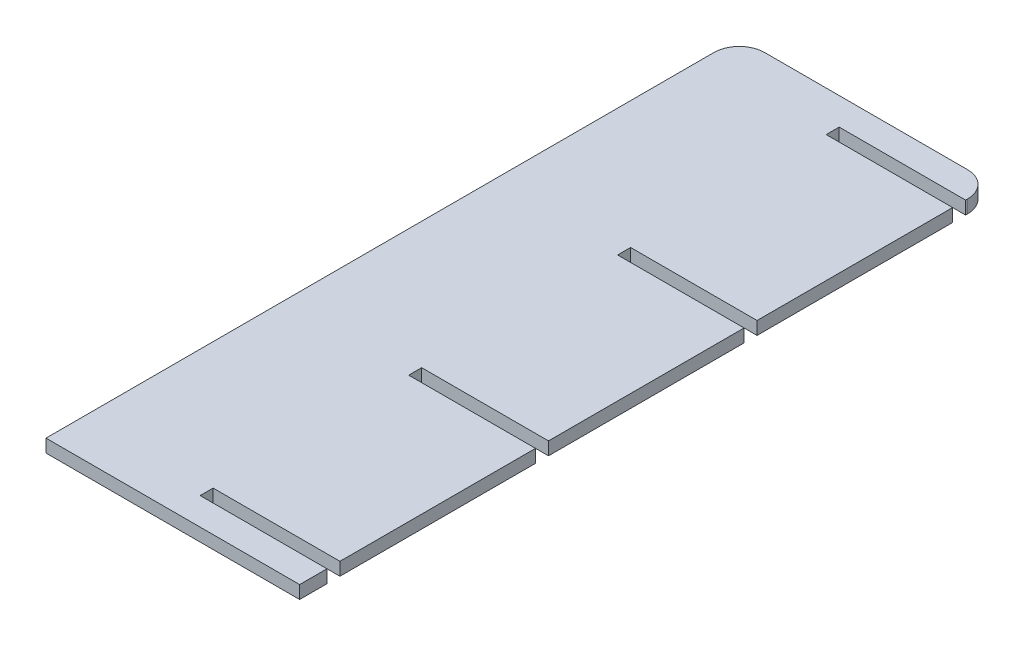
ISO-10303-21;
HEADER;
FILE_DESCRIPTION(('STEP AP214'),'2;1');
FILE_NAME('part.step','',(''),(''),'','','');
FILE_SCHEMA(('AUTOMOTIVE_DESIGN { 1 0 10303 214 1 1 1 1 }'));
ENDSEC;
DATA;
#1=APPLICATION_CONTEXT('core data for automotive mechanical design processes');
#2=APPLICATION_PROTOCOL_DEFINITION('international standard','automotive_design',2000,#1);
#3=PRODUCT_CONTEXT('',#1,'mechanical');
#4=PRODUCT('Part','Part','',(#3));
#5=PRODUCT_RELATED_PRODUCT_CATEGORY('part','',(#4));
#6=PRODUCT_DEFINITION_FORMATION('','',#4);
#7=PRODUCT_DEFINITION_CONTEXT('part definition',#1,'design');
#8=PRODUCT_DEFINITION('design','',#6,#7);
#9=PRODUCT_DEFINITION_SHAPE('','',#8);
#10=(LENGTH_UNIT() NAMED_UNIT(*) SI_UNIT(.MILLI.,.METRE.));
#11=(NAMED_UNIT(*) PLANE_ANGLE_UNIT() SI_UNIT($,.RADIAN.));
#12=(NAMED_UNIT(*) SI_UNIT($,.STERADIAN.) SOLID_ANGLE_UNIT());
#13=UNCERTAINTY_MEASURE_WITH_UNIT(LENGTH_MEASURE(1.E-05),#10,'distance_accuracy_value','');
#14=(GEOMETRIC_REPRESENTATION_CONTEXT(3) GLOBAL_UNCERTAINTY_ASSIGNED_CONTEXT((#13)) GLOBAL_UNIT_ASSIGNED_CONTEXT((#10,
#11,#12)) REPRESENTATION_CONTEXT('',''));
#15=CARTESIAN_POINT('',(0.,0.,0.));
#16=DIRECTION('',(0.,0.,1.));
#17=DIRECTION('',(1.,0.,0.));
#18=AXIS2_PLACEMENT_3D('',#15,#16,#17);
#19=CARTESIAN_POINT('',(-56.9860454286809,23.,-754.229373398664));
#20=DIRECTION('',(1.,0.,0.));
#21=DIRECTION('',(0.,0.,-1.));
#22=AXIS2_PLACEMENT_3D('',#19,#20,#21);
#23=PLANE('',#22);
#24=DIRECTION('',(0.,0.,1.));
#25=VECTOR('',#24,1.);
#26=CARTESIAN_POINT('',(-56.9860454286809,0.,-754.229373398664));
#27=LINE('',#26,#25);
#28=CARTESIAN_POINT('',(-56.9860454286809,0.,-754.229373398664));
#29=VERTEX_POINT('',#28);
#30=CARTESIAN_POINT('',(-56.9860454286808,0.,430.770626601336));
#31=VERTEX_POINT('',#30);
#32=EDGE_CURVE('E212',#29,#31,#27,.T.);
#33=ORIENTED_EDGE('',*,*,#32,.T.);
#34=DIRECTION('',(0.,-1.,0.));
#35=VECTOR('',#34,1.);
#36=CARTESIAN_POINT('',(-56.9860454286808,23.,430.770626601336));
#37=LINE('',#36,#35);
#38=CARTESIAN_POINT('',(-56.9860454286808,23.,430.770626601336));
#39=VERTEX_POINT('',#38);
#40=EDGE_CURVE('E11',#39,#31,#37,.T.);
#41=ORIENTED_EDGE('',*,*,#40,.F.);
#42=DIRECTION('',(0.,0.,1.));
#43=VECTOR('',#42,1.);
#44=CARTESIAN_POINT('',(-56.9860454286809,23.,-754.229373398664));
#45=LINE('',#44,#43);
#46=CARTESIAN_POINT('',(-56.9860454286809,23.,-754.229373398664));
#47=VERTEX_POINT('',#46);
#48=EDGE_CURVE('E254',#47,#39,#45,.T.);
#49=ORIENTED_EDGE('',*,*,#48,.F.);
#50=DIRECTION('',(0.,-1.,0.));
#51=VECTOR('',#50,1.);
#52=CARTESIAN_POINT('',(-56.9860454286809,23.,-754.229373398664));
#53=LINE('',#52,#51);
#54=EDGE_CURVE('E208',#47,#29,#53,.T.);
#55=ORIENTED_EDGE('',*,*,#54,.T.);
#56=EDGE_LOOP('',(#33,#41,#49,#55));
#57=FACE_BOUND('',#56,.T.);
#58=ADVANCED_FACE('F32',(#57),#23,.F.);
#59=CARTESIAN_POINT('',(-56.9860454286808,23.,430.770626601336));
#60=DIRECTION('',(0.,0.,-1.));
#61=DIRECTION('',(-1.,0.,0.));
#62=AXIS2_PLACEMENT_3D('',#59,#60,#61);
#63=PLANE('',#62);
#64=DIRECTION('',(1.,0.,0.));
#65=VECTOR('',#64,1.);
#66=CARTESIAN_POINT('',(-56.9860454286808,0.,430.770626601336));
#67=LINE('',#66,#65);
#68=CARTESIAN_POINT('',(393.013954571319,0.,430.770626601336));
#69=VERTEX_POINT('',#68);
#70=EDGE_CURVE('E215',#31,#69,#67,.T.);
#71=ORIENTED_EDGE('',*,*,#70,.T.);
#72=DIRECTION('',(0.,-1.,0.));
#73=VECTOR('',#72,1.);
#74=CARTESIAN_POINT('',(393.013954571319,23.,430.770626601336));
#75=LINE('',#74,#73);
#76=CARTESIAN_POINT('',(393.013954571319,23.,430.770626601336));
#77=VERTEX_POINT('',#76);
#78=EDGE_CURVE('E40',#77,#69,#75,.T.);
#79=ORIENTED_EDGE('',*,*,#78,.F.);
#80=DIRECTION('',(1.,0.,0.));
#81=VECTOR('',#80,1.);
#82=CARTESIAN_POINT('',(-56.9860454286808,23.,430.770626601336));
#83=LINE('',#82,#81);
#84=EDGE_CURVE('E133',#39,#77,#83,.T.);
#85=ORIENTED_EDGE('',*,*,#84,.F.);
#86=ORIENTED_EDGE('',*,*,#40,.T.);
#87=EDGE_LOOP('',(#71,#79,#85,#86));
#88=FACE_BOUND('',#87,.T.);
#89=ADVANCED_FACE('F382',(#88),#63,.F.);
#90=CARTESIAN_POINT('',(393.013954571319,23.,430.770626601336));
#91=DIRECTION('',(-1.,0.,0.));
#92=DIRECTION('',(0.,0.,1.));
#93=AXIS2_PLACEMENT_3D('',#90,#91,#92);
#94=PLANE('',#93);
#95=DIRECTION('',(0.,0.,-1.));
#96=VECTOR('',#95,1.);
#97=CARTESIAN_POINT('',(393.013954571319,0.,430.770626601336));
#98=LINE('',#97,#96);
#99=CARTESIAN_POINT('',(393.013954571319,0.,382.270626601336));
#100=VERTEX_POINT('',#99);
#101=EDGE_CURVE('E217',#69,#100,#98,.T.);
#102=ORIENTED_EDGE('',*,*,#101,.T.);
#103=DIRECTION('',(0.,-1.,0.));
#104=VECTOR('',#103,1.);
#105=CARTESIAN_POINT('',(393.013954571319,23.,382.270626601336));
#106=LINE('',#105,#104);
#107=CARTESIAN_POINT('',(393.013954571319,23.,382.270626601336));
#108=VERTEX_POINT('',#107);
#109=EDGE_CURVE('E303',#108,#100,#106,.T.);
#110=ORIENTED_EDGE('',*,*,#109,.F.);
#111=DIRECTION('',(0.,0.,-1.));
#112=VECTOR('',#111,1.);
#113=CARTESIAN_POINT('',(393.013954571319,23.,430.770626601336));
#114=LINE('',#113,#112);
#115=EDGE_CURVE('E311',#77,#108,#114,.T.);
#116=ORIENTED_EDGE('',*,*,#115,.F.);
#117=ORIENTED_EDGE('',*,*,#78,.T.);
#118=EDGE_LOOP('',(#102,#110,#116,#117));
#119=FACE_BOUND('',#118,.T.);
#120=ADVANCED_FACE('F309',(#119),#94,.F.);
#121=CARTESIAN_POINT('',(393.013954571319,23.,382.270626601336));
#122=DIRECTION('',(0.,0.,1.));
#123=DIRECTION('',(1.,0.,0.));
#124=AXIS2_PLACEMENT_3D('',#121,#122,#123);
#125=PLANE('',#124);
#126=DIRECTION('',(-1.,0.,0.));
#127=VECTOR('',#126,1.);
#128=CARTESIAN_POINT('',(393.013954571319,0.,382.270626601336));
#129=LINE('',#128,#127);
#130=CARTESIAN_POINT('',(168.013954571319,0.,382.270626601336));
#131=VERTEX_POINT('',#130);
#132=EDGE_CURVE('E219',#100,#131,#129,.T.);
#133=ORIENTED_EDGE('',*,*,#132,.T.);
#134=DIRECTION('',(0.,-1.,0.));
#135=VECTOR('',#134,1.);
#136=CARTESIAN_POINT('',(168.013954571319,23.,382.270626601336));
#137=LINE('',#136,#135);
#138=CARTESIAN_POINT('',(168.013954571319,23.,382.270626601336));
#139=VERTEX_POINT('',#138);
#140=EDGE_CURVE('E300',#139,#131,#137,.T.);
#141=ORIENTED_EDGE('',*,*,#140,.F.);
#142=DIRECTION('',(-1.,0.,0.));
#143=VECTOR('',#142,1.);
#144=CARTESIAN_POINT('',(393.013954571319,23.,382.270626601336));
#145=LINE('',#144,#143);
#146=EDGE_CURVE('E329',#108,#139,#145,.T.);
#147=ORIENTED_EDGE('',*,*,#146,.F.);
#148=ORIENTED_EDGE('',*,*,#109,.T.);
#149=EDGE_LOOP('',(#133,#141,#147,#148));
#150=FACE_BOUND('',#149,.T.);
#151=ADVANCED_FACE('F320',(#150),#125,.F.);
#152=CARTESIAN_POINT('',(168.013954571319,23.,382.270626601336));
#153=DIRECTION('',(-1.,0.,0.));
#154=DIRECTION('',(0.,0.,1.));
#155=AXIS2_PLACEMENT_3D('',#152,#153,#154);
#156=PLANE('',#155);
#157=DIRECTION('',(0.,0.,-1.));
#158=VECTOR('',#157,1.);
#159=CARTESIAN_POINT('',(168.013954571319,0.,382.270626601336));
#160=LINE('',#159,#158);
#161=CARTESIAN_POINT('',(168.013954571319,0.,359.270626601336));
#162=VERTEX_POINT('',#161);
#163=EDGE_CURVE('E221',#131,#162,#160,.T.);
#164=ORIENTED_EDGE('',*,*,#163,.T.);
#165=DIRECTION('',(0.,-1.,0.));
#166=VECTOR('',#165,1.);
#167=CARTESIAN_POINT('',(168.013954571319,23.,359.270626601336));
#168=LINE('',#167,#166);
#169=CARTESIAN_POINT('',(168.013954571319,23.,359.270626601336));
#170=VERTEX_POINT('',#169);
#171=EDGE_CURVE('E297',#170,#162,#168,.T.);
#172=ORIENTED_EDGE('',*,*,#171,.F.);
#173=DIRECTION('',(0.,0.,-1.));
#174=VECTOR('',#173,1.);
#175=CARTESIAN_POINT('',(168.013954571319,23.,382.270626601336));
#176=LINE('',#175,#174);
#177=EDGE_CURVE('E326',#139,#170,#176,.T.);
#178=ORIENTED_EDGE('',*,*,#177,.F.);
#179=ORIENTED_EDGE('',*,*,#140,.T.);
#180=EDGE_LOOP('',(#164,#172,#178,#179));
#181=FACE_BOUND('',#180,.T.);
#182=ADVANCED_FACE('F324',(#181),#156,.F.);
#183=CARTESIAN_POINT('',(168.013954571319,23.,359.270626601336));
#184=DIRECTION('',(0.,0.,-1.));
#185=DIRECTION('',(-1.,0.,0.));
#186=AXIS2_PLACEMENT_3D('',#183,#184,#185);
#187=PLANE('',#186);
#188=DIRECTION('',(1.,0.,0.));
#189=VECTOR('',#188,1.);
#190=CARTESIAN_POINT('',(168.013954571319,0.,359.270626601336));
#191=LINE('',#190,#189);
#192=CARTESIAN_POINT('',(393.013954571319,0.,359.270626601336));
#193=VERTEX_POINT('',#192);
#194=EDGE_CURVE('E223',#162,#193,#191,.T.);
#195=ORIENTED_EDGE('',*,*,#194,.T.);
#196=DIRECTION('',(0.,-1.,0.));
#197=VECTOR('',#196,1.);
#198=CARTESIAN_POINT('',(393.013954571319,23.,359.270626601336));
#199=LINE('',#198,#197);
#200=CARTESIAN_POINT('',(393.013954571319,23.,359.270626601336));
#201=VERTEX_POINT('',#200);
#202=EDGE_CURVE('E294',#201,#193,#199,.T.);
#203=ORIENTED_EDGE('',*,*,#202,.F.);
#204=DIRECTION('',(1.,0.,0.));
#205=VECTOR('',#204,1.);
#206=CARTESIAN_POINT('',(168.013954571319,23.,359.270626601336));
#207=LINE('',#206,#205);
#208=EDGE_CURVE('E328',#170,#201,#207,.T.);
#209=ORIENTED_EDGE('',*,*,#208,.F.);
#210=ORIENTED_EDGE('',*,*,#171,.T.);
#211=EDGE_LOOP('',(#195,#203,#209,#210));
#212=FACE_BOUND('',#211,.T.);
#213=ADVANCED_FACE('F395',(#212),#187,.F.);
#214=CARTESIAN_POINT('',(393.013954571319,23.,359.270626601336));
#215=DIRECTION('',(-1.,0.,0.));
#216=DIRECTION('',(0.,0.,1.));
#217=AXIS2_PLACEMENT_3D('',#214,#215,#216);
#218=PLANE('',#217);
#219=DIRECTION('',(0.,0.,-1.));
#220=VECTOR('',#219,1.);
#221=CARTESIAN_POINT('',(393.013954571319,0.,359.270626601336));
#222=LINE('',#221,#220);
#223=CARTESIAN_POINT('',(393.013954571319,0.,12.2706266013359));
#224=VERTEX_POINT('',#223);
#225=EDGE_CURVE('E225',#193,#224,#222,.T.);
#226=ORIENTED_EDGE('',*,*,#225,.T.);
#227=DIRECTION('',(0.,-1.,0.));
#228=VECTOR('',#227,1.);
#229=CARTESIAN_POINT('',(393.013954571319,23.,12.2706266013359));
#230=LINE('',#229,#228);
#231=CARTESIAN_POINT('',(393.013954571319,23.,12.2706266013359));
#232=VERTEX_POINT('',#231);
#233=EDGE_CURVE('E291',#232,#224,#230,.T.);
#234=ORIENTED_EDGE('',*,*,#233,.F.);
#235=DIRECTION('',(0.,0.,-1.));
#236=VECTOR('',#235,1.);
#237=CARTESIAN_POINT('',(393.013954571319,23.,359.270626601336));
#238=LINE('',#237,#236);
#239=EDGE_CURVE('E331',#201,#232,#238,.T.);
#240=ORIENTED_EDGE('',*,*,#239,.F.);
#241=ORIENTED_EDGE('',*,*,#202,.T.);
#242=EDGE_LOOP('',(#226,#234,#240,#241));
#243=FACE_BOUND('',#242,.T.);
#244=ADVANCED_FACE('F398',(#243),#218,.F.);
#245=CARTESIAN_POINT('',(393.013954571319,23.,12.2706266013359));
#246=DIRECTION('',(0.,0.,1.));
#247=DIRECTION('',(1.,0.,0.));
#248=AXIS2_PLACEMENT_3D('',#245,#246,#247);
#249=PLANE('',#248);
#250=DIRECTION('',(-1.,0.,0.));
#251=VECTOR('',#250,1.);
#252=CARTESIAN_POINT('',(393.013954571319,0.,12.2706266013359));
#253=LINE('',#252,#251);
#254=CARTESIAN_POINT('',(168.013954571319,0.,12.2706266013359));
#255=VERTEX_POINT('',#254);
#256=EDGE_CURVE('E227',#224,#255,#253,.T.);
#257=ORIENTED_EDGE('',*,*,#256,.T.);
#258=DIRECTION('',(0.,-1.,0.));
#259=VECTOR('',#258,1.);
#260=CARTESIAN_POINT('',(168.013954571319,23.,12.2706266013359));
#261=LINE('',#260,#259);
#262=CARTESIAN_POINT('',(168.013954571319,23.,12.2706266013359));
#263=VERTEX_POINT('',#262);
#264=EDGE_CURVE('E288',#263,#255,#261,.T.);
#265=ORIENTED_EDGE('',*,*,#264,.F.);
#266=DIRECTION('',(-1.,0.,0.));
#267=VECTOR('',#266,1.);
#268=CARTESIAN_POINT('',(393.013954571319,23.,12.2706266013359));
#269=LINE('',#268,#267);
#270=EDGE_CURVE('E337',#232,#263,#269,.T.);
#271=ORIENTED_EDGE('',*,*,#270,.F.);
#272=ORIENTED_EDGE('',*,*,#233,.T.);
#273=EDGE_LOOP('',(#257,#265,#271,#272));
#274=FACE_BOUND('',#273,.T.);
#275=ADVANCED_FACE('F402',(#274),#249,.F.);
#276=CARTESIAN_POINT('',(168.013954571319,23.,12.2706266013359));
#277=DIRECTION('',(-1.,0.,0.));
#278=DIRECTION('',(0.,0.,1.));
#279=AXIS2_PLACEMENT_3D('',#276,#277,#278);
#280=PLANE('',#279);
#281=DIRECTION('',(0.,0.,-1.));
#282=VECTOR('',#281,1.);
#283=CARTESIAN_POINT('',(168.013954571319,0.,12.2706266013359));
#284=LINE('',#283,#282);
#285=CARTESIAN_POINT('',(168.013954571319,0.,-10.7293733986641));
#286=VERTEX_POINT('',#285);
#287=EDGE_CURVE('E229',#255,#286,#284,.T.);
#288=ORIENTED_EDGE('',*,*,#287,.T.);
#289=DIRECTION('',(0.,-1.,0.));
#290=VECTOR('',#289,1.);
#291=CARTESIAN_POINT('',(168.013954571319,23.,-10.7293733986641));
#292=LINE('',#291,#290);
#293=CARTESIAN_POINT('',(168.013954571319,23.,-10.7293733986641));
#294=VERTEX_POINT('',#293);
#295=EDGE_CURVE('E285',#294,#286,#292,.T.);
#296=ORIENTED_EDGE('',*,*,#295,.F.);
#297=DIRECTION('',(0.,0.,-1.));
#298=VECTOR('',#297,1.);
#299=CARTESIAN_POINT('',(168.013954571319,23.,12.2706266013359));
#300=LINE('',#299,#298);
#301=EDGE_CURVE('E339',#263,#294,#300,.T.);
#302=ORIENTED_EDGE('',*,*,#301,.F.);
#303=ORIENTED_EDGE('',*,*,#264,.T.);
#304=EDGE_LOOP('',(#288,#296,#302,#303));
#305=FACE_BOUND('',#304,.T.);
#306=ADVANCED_FACE('F406',(#305),#280,.F.);
#307=CARTESIAN_POINT('',(168.013954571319,23.,-10.7293733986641));
#308=DIRECTION('',(0.,0.,-1.));
#309=DIRECTION('',(-1.,0.,0.));
#310=AXIS2_PLACEMENT_3D('',#307,#308,#309);
#311=PLANE('',#310);
#312=DIRECTION('',(1.,0.,0.));
#313=VECTOR('',#312,1.);
#314=CARTESIAN_POINT('',(168.013954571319,0.,-10.7293733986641));
#315=LINE('',#314,#313);
#316=CARTESIAN_POINT('',(393.013954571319,0.,-10.7293733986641));
#317=VERTEX_POINT('',#316);
#318=EDGE_CURVE('E231',#286,#317,#315,.T.);
#319=ORIENTED_EDGE('',*,*,#318,.T.);
#320=DIRECTION('',(0.,-1.,0.));
#321=VECTOR('',#320,1.);
#322=CARTESIAN_POINT('',(393.013954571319,23.,-10.7293733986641));
#323=LINE('',#322,#321);
#324=CARTESIAN_POINT('',(393.013954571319,23.,-10.7293733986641));
#325=VERTEX_POINT('',#324);
#326=EDGE_CURVE('E282',#325,#317,#323,.T.);
#327=ORIENTED_EDGE('',*,*,#326,.F.);
#328=DIRECTION('',(1.,0.,0.));
#329=VECTOR('',#328,1.);
#330=CARTESIAN_POINT('',(168.013954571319,23.,-10.7293733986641));
#331=LINE('',#330,#329);
#332=EDGE_CURVE('E341',#294,#325,#331,.T.);
#333=ORIENTED_EDGE('',*,*,#332,.F.);
#334=ORIENTED_EDGE('',*,*,#295,.T.);
#335=EDGE_LOOP('',(#319,#327,#333,#334));
#336=FACE_BOUND('',#335,.T.);
#337=ADVANCED_FACE('F410',(#336),#311,.F.);
#338=CARTESIAN_POINT('',(393.013954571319,23.,-10.7293733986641));
#339=DIRECTION('',(-1.,0.,0.));
#340=DIRECTION('',(0.,0.,1.));
#341=AXIS2_PLACEMENT_3D('',#338,#339,#340);
#342=PLANE('',#341);
#343=DIRECTION('',(0.,0.,-1.));
#344=VECTOR('',#343,1.);
#345=CARTESIAN_POINT('',(393.013954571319,0.,-10.7293733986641));
#346=LINE('',#345,#344);
#347=CARTESIAN_POINT('',(393.013954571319,0.,-357.729373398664));
#348=VERTEX_POINT('',#347);
#349=EDGE_CURVE('E233',#317,#348,#346,.T.);
#350=ORIENTED_EDGE('',*,*,#349,.T.);
#351=DIRECTION('',(0.,-1.,0.));
#352=VECTOR('',#351,1.);
#353=CARTESIAN_POINT('',(393.013954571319,23.,-357.729373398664));
#354=LINE('',#353,#352);
#355=CARTESIAN_POINT('',(393.013954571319,23.,-357.729373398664));
#356=VERTEX_POINT('',#355);
#357=EDGE_CURVE('E279',#356,#348,#354,.T.);
#358=ORIENTED_EDGE('',*,*,#357,.F.);
#359=DIRECTION('',(0.,0.,-1.));
#360=VECTOR('',#359,1.);
#361=CARTESIAN_POINT('',(393.013954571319,23.,-10.7293733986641));
#362=LINE('',#361,#360);
#363=EDGE_CURVE('E343',#325,#356,#362,.T.);
#364=ORIENTED_EDGE('',*,*,#363,.F.);
#365=ORIENTED_EDGE('',*,*,#326,.T.);
#366=EDGE_LOOP('',(#350,#358,#364,#365));
#367=FACE_BOUND('',#366,.T.);
#368=ADVANCED_FACE('F414',(#367),#342,.F.);
#369=CARTESIAN_POINT('',(393.013954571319,23.,-357.729373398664));
#370=DIRECTION('',(0.,0.,1.));
#371=DIRECTION('',(1.,0.,0.));
#372=AXIS2_PLACEMENT_3D('',#369,#370,#371);
#373=PLANE('',#372);
#374=DIRECTION('',(-1.,0.,0.));
#375=VECTOR('',#374,1.);
#376=CARTESIAN_POINT('',(393.013954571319,0.,-357.729373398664));
#377=LINE('',#376,#375);
#378=CARTESIAN_POINT('',(168.716438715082,0.,-357.729373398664));
#379=VERTEX_POINT('',#378);
#380=EDGE_CURVE('E235',#348,#379,#377,.T.);
#381=ORIENTED_EDGE('',*,*,#380,.T.);
#382=DIRECTION('',(0.,-1.,0.));
#383=VECTOR('',#382,1.);
#384=CARTESIAN_POINT('',(168.716438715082,23.,-357.729373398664));
#385=LINE('',#384,#383);
#386=CARTESIAN_POINT('',(168.716438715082,23.,-357.729373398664));
#387=VERTEX_POINT('',#386);
#388=EDGE_CURVE('E276',#387,#379,#385,.T.);
#389=ORIENTED_EDGE('',*,*,#388,.F.);
#390=DIRECTION('',(-1.,0.,0.));
#391=VECTOR('',#390,1.);
#392=CARTESIAN_POINT('',(393.013954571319,23.,-357.729373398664));
#393=LINE('',#392,#391);
#394=EDGE_CURVE('E345',#356,#387,#393,.T.);
#395=ORIENTED_EDGE('',*,*,#394,.F.);
#396=ORIENTED_EDGE('',*,*,#357,.T.);
#397=EDGE_LOOP('',(#381,#389,#395,#396));
#398=FACE_BOUND('',#397,.T.);
#399=ADVANCED_FACE('F418',(#398),#373,.F.);
#400=CARTESIAN_POINT('',(168.716438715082,23.,-357.729373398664));
#401=DIRECTION('',(-1.,0.,0.));
#402=DIRECTION('',(0.,0.,1.));
#403=AXIS2_PLACEMENT_3D('',#400,#401,#402);
#404=PLANE('',#403);
#405=DIRECTION('',(0.,0.,-1.));
#406=VECTOR('',#405,1.);
#407=CARTESIAN_POINT('',(168.716438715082,0.,-357.729373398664));
#408=LINE('',#407,#406);
#409=CARTESIAN_POINT('',(168.716438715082,0.,-380.729373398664));
#410=VERTEX_POINT('',#409);
#411=EDGE_CURVE('E237',#379,#410,#408,.T.);
#412=ORIENTED_EDGE('',*,*,#411,.T.);
#413=DIRECTION('',(0.,-1.,0.));
#414=VECTOR('',#413,1.);
#415=CARTESIAN_POINT('',(168.716438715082,23.,-380.729373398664));
#416=LINE('',#415,#414);
#417=CARTESIAN_POINT('',(168.716438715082,23.,-380.729373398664));
#418=VERTEX_POINT('',#417);
#419=EDGE_CURVE('E273',#418,#410,#416,.T.);
#420=ORIENTED_EDGE('',*,*,#419,.F.);
#421=DIRECTION('',(0.,0.,-1.));
#422=VECTOR('',#421,1.);
#423=CARTESIAN_POINT('',(168.716438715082,23.,-357.729373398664));
#424=LINE('',#423,#422);
#425=EDGE_CURVE('E347',#387,#418,#424,.T.);
#426=ORIENTED_EDGE('',*,*,#425,.F.);
#427=ORIENTED_EDGE('',*,*,#388,.T.);
#428=EDGE_LOOP('',(#412,#420,#426,#427));
#429=FACE_BOUND('',#428,.T.);
#430=ADVANCED_FACE('F422',(#429),#404,.F.);
#431=CARTESIAN_POINT('',(168.716438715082,23.,-380.729373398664));
#432=DIRECTION('',(0.,0.,-1.));
#433=DIRECTION('',(-1.,0.,0.));
#434=AXIS2_PLACEMENT_3D('',#431,#432,#433);
#435=PLANE('',#434);
#436=DIRECTION('',(1.,0.,0.));
#437=VECTOR('',#436,1.);
#438=CARTESIAN_POINT('',(168.716438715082,0.,-380.729373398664));
#439=LINE('',#438,#437);
#440=CARTESIAN_POINT('',(393.013954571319,0.,-380.729373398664));
#441=VERTEX_POINT('',#440);
#442=EDGE_CURVE('E239',#410,#441,#439,.T.);
#443=ORIENTED_EDGE('',*,*,#442,.T.);
#444=DIRECTION('',(0.,-1.,0.));
#445=VECTOR('',#444,1.);
#446=CARTESIAN_POINT('',(393.013954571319,23.,-380.729373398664));
#447=LINE('',#446,#445);
#448=CARTESIAN_POINT('',(393.013954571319,23.,-380.729373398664));
#449=VERTEX_POINT('',#448);
#450=EDGE_CURVE('E270',#449,#441,#447,.T.);
#451=ORIENTED_EDGE('',*,*,#450,.F.);
#452=DIRECTION('',(1.,0.,0.));
#453=VECTOR('',#452,1.);
#454=CARTESIAN_POINT('',(168.716438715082,23.,-380.729373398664));
#455=LINE('',#454,#453);
#456=EDGE_CURVE('E349',#418,#449,#455,.T.);
#457=ORIENTED_EDGE('',*,*,#456,.F.);
#458=ORIENTED_EDGE('',*,*,#419,.T.);
#459=EDGE_LOOP('',(#443,#451,#457,#458));
#460=FACE_BOUND('',#459,.T.);
#461=ADVANCED_FACE('F426',(#460),#435,.F.);
#462=CARTESIAN_POINT('',(393.013954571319,23.,-380.729373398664));
#463=DIRECTION('',(-1.,0.,0.));
#464=DIRECTION('',(0.,0.,1.));
#465=AXIS2_PLACEMENT_3D('',#462,#463,#464);
#466=PLANE('',#465);
#467=DIRECTION('',(0.,0.,-1.));
#468=VECTOR('',#467,1.);
#469=CARTESIAN_POINT('',(393.013954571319,0.,-380.729373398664));
#470=LINE('',#469,#468);
#471=CARTESIAN_POINT('',(393.013954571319,0.,-727.729373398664));
#472=VERTEX_POINT('',#471);
#473=EDGE_CURVE('E241',#441,#472,#470,.T.);
#474=ORIENTED_EDGE('',*,*,#473,.T.);
#475=DIRECTION('',(0.,-1.,0.));
#476=VECTOR('',#475,1.);
#477=CARTESIAN_POINT('',(393.013954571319,23.,-727.729373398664));
#478=LINE('',#477,#476);
#479=CARTESIAN_POINT('',(393.013954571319,23.,-727.729373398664));
#480=VERTEX_POINT('',#479);
#481=EDGE_CURVE('E267',#480,#472,#478,.T.);
#482=ORIENTED_EDGE('',*,*,#481,.F.);
#483=DIRECTION('',(0.,0.,-1.));
#484=VECTOR('',#483,1.);
#485=CARTESIAN_POINT('',(393.013954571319,23.,-380.729373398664));
#486=LINE('',#485,#484);
#487=EDGE_CURVE('E351',#449,#480,#486,.T.);
#488=ORIENTED_EDGE('',*,*,#487,.F.);
#489=ORIENTED_EDGE('',*,*,#450,.T.);
#490=EDGE_LOOP('',(#474,#482,#488,#489));
#491=FACE_BOUND('',#490,.T.);
#492=ADVANCED_FACE('F430',(#491),#466,.F.);
#493=CARTESIAN_POINT('',(393.013954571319,23.,-727.729373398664));
#494=DIRECTION('',(0.,0.,1.));
#495=DIRECTION('',(1.,0.,0.));
#496=AXIS2_PLACEMENT_3D('',#493,#494,#495);
#497=PLANE('',#496);
#498=DIRECTION('',(-1.,0.,0.));
#499=VECTOR('',#498,1.);
#500=CARTESIAN_POINT('',(393.013954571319,0.,-727.729373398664));
#501=LINE('',#500,#499);
#502=CARTESIAN_POINT('',(168.716438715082,0.,-727.729373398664));
#503=VERTEX_POINT('',#502);
#504=EDGE_CURVE('E243',#472,#503,#501,.T.);
#505=ORIENTED_EDGE('',*,*,#504,.T.);
#506=DIRECTION('',(0.,-1.,0.));
#507=VECTOR('',#506,1.);
#508=CARTESIAN_POINT('',(168.716438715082,23.,-727.729373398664));
#509=LINE('',#508,#507);
#510=CARTESIAN_POINT('',(168.716438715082,23.,-727.729373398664));
#511=VERTEX_POINT('',#510);
#512=EDGE_CURVE('E264',#511,#503,#509,.T.);
#513=ORIENTED_EDGE('',*,*,#512,.F.);
#514=DIRECTION('',(-1.,0.,0.));
#515=VECTOR('',#514,1.);
#516=CARTESIAN_POINT('',(393.013954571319,23.,-727.729373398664));
#517=LINE('',#516,#515);
#518=EDGE_CURVE('E353',#480,#511,#517,.T.);
#519=ORIENTED_EDGE('',*,*,#518,.F.);
#520=ORIENTED_EDGE('',*,*,#481,.T.);
#521=EDGE_LOOP('',(#505,#513,#519,#520));
#522=FACE_BOUND('',#521,.T.);
#523=ADVANCED_FACE('F434',(#522),#497,.F.);
#524=CARTESIAN_POINT('',(168.716438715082,23.,-727.729373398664));
#525=DIRECTION('',(-1.,0.,0.));
#526=DIRECTION('',(0.,0.,1.));
#527=AXIS2_PLACEMENT_3D('',#524,#525,#526);
#528=PLANE('',#527);
#529=DIRECTION('',(0.,0.,-1.));
#530=VECTOR('',#529,1.);
#531=CARTESIAN_POINT('',(168.716438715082,0.,-727.729373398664));
#532=LINE('',#531,#530);
#533=CARTESIAN_POINT('',(168.716438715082,0.,-750.729373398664));
#534=VERTEX_POINT('',#533);
#535=EDGE_CURVE('E245',#503,#534,#532,.T.);
#536=ORIENTED_EDGE('',*,*,#535,.T.);
#537=DIRECTION('',(0.,-1.,0.));
#538=VECTOR('',#537,1.);
#539=CARTESIAN_POINT('',(168.716438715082,23.,-750.729373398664));
#540=LINE('',#539,#538);
#541=CARTESIAN_POINT('',(168.716438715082,23.,-750.729373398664));
#542=VERTEX_POINT('',#541);
#543=EDGE_CURVE('E261',#542,#534,#540,.T.);
#544=ORIENTED_EDGE('',*,*,#543,.F.);
#545=DIRECTION('',(0.,0.,-1.));
#546=VECTOR('',#545,1.);
#547=CARTESIAN_POINT('',(168.716438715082,23.,-727.729373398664));
#548=LINE('',#547,#546);
#549=EDGE_CURVE('E355',#511,#542,#548,.T.);
#550=ORIENTED_EDGE('',*,*,#549,.F.);
#551=ORIENTED_EDGE('',*,*,#512,.T.);
#552=EDGE_LOOP('',(#536,#544,#550,#551));
#553=FACE_BOUND('',#552,.T.);
#554=ADVANCED_FACE('F438',(#553),#528,.F.);
#555=CARTESIAN_POINT('',(168.716438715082,23.,-750.729373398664));
#556=DIRECTION('',(0.,0.,-1.));
#557=DIRECTION('',(-1.,0.,0.));
#558=AXIS2_PLACEMENT_3D('',#555,#556,#557);
#559=PLANE('',#558);
#560=DIRECTION('',(1.,0.,0.));
#561=VECTOR('',#560,1.);
#562=CARTESIAN_POINT('',(168.716438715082,0.,-750.729373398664));
#563=LINE('',#562,#561);
#564=CARTESIAN_POINT('',(393.013954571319,0.,-750.729373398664));
#565=VERTEX_POINT('',#564);
#566=EDGE_CURVE('E247',#534,#565,#563,.T.);
#567=ORIENTED_EDGE('',*,*,#566,.T.);
#568=DIRECTION('',(0.,-1.,0.));
#569=VECTOR('',#568,1.);
#570=CARTESIAN_POINT('',(393.013954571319,23.,-750.729373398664));
#571=LINE('',#570,#569);
#572=CARTESIAN_POINT('',(393.013954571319,23.,-750.729373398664));
#573=VERTEX_POINT('',#572);
#574=EDGE_CURVE('E258',#573,#565,#571,.T.);
#575=ORIENTED_EDGE('',*,*,#574,.F.);
#576=DIRECTION('',(1.,0.,0.));
#577=VECTOR('',#576,1.);
#578=CARTESIAN_POINT('',(168.716438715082,23.,-750.729373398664));
#579=LINE('',#578,#577);
#580=EDGE_CURVE('E357',#542,#573,#579,.T.);
#581=ORIENTED_EDGE('',*,*,#580,.F.);
#582=ORIENTED_EDGE('',*,*,#543,.T.);
#583=EDGE_LOOP('',(#567,#575,#581,#582));
#584=FACE_BOUND('',#583,.T.);
#585=ADVANCED_FACE('F363',(#584),#559,.F.);
#586=CARTESIAN_POINT('',(393.013954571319,23.,-750.729373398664));
#587=DIRECTION('',(-1.,0.,0.));
#588=DIRECTION('',(0.,0.,1.));
#589=AXIS2_PLACEMENT_3D('',#586,#587,#588);
#590=PLANE('',#589);
#591=DIRECTION('',(0.,0.,-1.));
#592=VECTOR('',#591,1.);
#593=CARTESIAN_POINT('',(393.013954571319,0.,-750.729373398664));
#594=LINE('',#593,#592);
#595=CARTESIAN_POINT('',(393.013954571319,0.,-754.229373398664));
#596=VERTEX_POINT('',#595);
#597=EDGE_CURVE('E249',#565,#596,#594,.T.);
#598=ORIENTED_EDGE('',*,*,#597,.T.);
#599=DIRECTION('',(0.,-1.,0.));
#600=VECTOR('',#599,1.);
#601=CARTESIAN_POINT('',(393.013954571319,23.,-754.229373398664));
#602=LINE('',#601,#600);
#603=CARTESIAN_POINT('',(393.013954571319,23.,-754.229373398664));
#604=VERTEX_POINT('',#603);
#605=EDGE_CURVE('E203',#604,#596,#602,.T.);
#606=ORIENTED_EDGE('',*,*,#605,.F.);
#607=DIRECTION('',(0.,0.,-1.));
#608=VECTOR('',#607,1.);
#609=CARTESIAN_POINT('',(393.013954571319,23.,-750.729373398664));
#610=LINE('',#609,#608);
#611=EDGE_CURVE('E194',#573,#604,#610,.T.);
#612=ORIENTED_EDGE('',*,*,#611,.F.);
#613=ORIENTED_EDGE('',*,*,#574,.T.);
#614=EDGE_LOOP('',(#598,#606,#612,#613));
#615=FACE_BOUND('',#614,.T.);
#616=ADVANCED_FACE('F367',(#615),#590,.F.);
#617=CARTESIAN_POINT('',(348.013954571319,23.,-754.229373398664));
#618=DIRECTION('',(0.,-1.,0.));
#619=DIRECTION('',(0.,0.,-1.));
#620=AXIS2_PLACEMENT_3D('',#617,#618,#619);
#621=CYLINDRICAL_SURFACE('',#620,45.);
#622=CARTESIAN_POINT('',(348.013954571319,0.,-754.229373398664));
#623=DIRECTION('',(0.,1.,0.));
#624=DIRECTION('',(0.,0.,1.));
#625=AXIS2_PLACEMENT_3D('',#622,#623,#624);
#626=CIRCLE('',#625,45.);
#627=CARTESIAN_POINT('',(348.013954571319,0.,-799.229373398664));
#628=VERTEX_POINT('',#627);
#629=EDGE_CURVE('E202',#596,#628,#626,.T.);
#630=ORIENTED_EDGE('',*,*,#629,.T.);
#631=DIRECTION('',(0.,-1.,0.));
#632=VECTOR('',#631,1.);
#633=CARTESIAN_POINT('',(348.013954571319,23.,-799.229373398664));
#634=LINE('',#633,#632);
#635=CARTESIAN_POINT('',(348.013954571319,23.,-799.229373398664));
#636=VERTEX_POINT('',#635);
#637=EDGE_CURVE('E199',#636,#628,#634,.T.);
#638=ORIENTED_EDGE('',*,*,#637,.F.);
#639=CARTESIAN_POINT('',(348.013954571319,23.,-754.229373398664));
#640=DIRECTION('',(0.,1.,0.));
#641=DIRECTION('',(0.,0.,1.));
#642=AXIS2_PLACEMENT_3D('',#639,#640,#641);
#643=CIRCLE('',#642,45.);
#644=EDGE_CURVE('E188',#604,#636,#643,.T.);
#645=ORIENTED_EDGE('',*,*,#644,.F.);
#646=ORIENTED_EDGE('',*,*,#605,.T.);
#647=EDGE_LOOP('',(#630,#638,#645,#646));
#648=FACE_BOUND('',#647,.T.);
#649=ADVANCED_FACE('F200',(#648),#621,.T.);
#650=CARTESIAN_POINT('',(348.013954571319,23.,-799.229373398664));
#651=DIRECTION('',(0.,0.,1.));
#652=DIRECTION('',(1.,0.,0.));
#653=AXIS2_PLACEMENT_3D('',#650,#651,#652);
#654=PLANE('',#653);
#655=DIRECTION('',(-1.,0.,0.));
#656=VECTOR('',#655,1.);
#657=CARTESIAN_POINT('',(348.013954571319,0.,-799.229373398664));
#658=LINE('',#657,#656);
#659=CARTESIAN_POINT('',(-11.9860454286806,0.,-799.229373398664));
#660=VERTEX_POINT('',#659);
#661=EDGE_CURVE('E119',#628,#660,#658,.T.);
#662=ORIENTED_EDGE('',*,*,#661,.T.);
#663=DIRECTION('',(0.,-1.,0.));
#664=VECTOR('',#663,1.);
#665=CARTESIAN_POINT('',(-11.9860454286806,23.,-799.229373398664));
#666=LINE('',#665,#664);
#667=CARTESIAN_POINT('',(-11.9860454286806,23.,-799.229373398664));
#668=VERTEX_POINT('',#667);
#669=EDGE_CURVE('E204',#668,#660,#666,.T.);
#670=ORIENTED_EDGE('',*,*,#669,.F.);
#671=DIRECTION('',(-1.,0.,0.));
#672=VECTOR('',#671,1.);
#673=CARTESIAN_POINT('',(348.013954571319,23.,-799.229373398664));
#674=LINE('',#673,#672);
#675=EDGE_CURVE('E192',#636,#668,#674,.T.);
#676=ORIENTED_EDGE('',*,*,#675,.F.);
#677=ORIENTED_EDGE('',*,*,#637,.T.);
#678=EDGE_LOOP('',(#662,#670,#676,#677));
#679=FACE_BOUND('',#678,.T.);
#680=ADVANCED_FACE('F206',(#679),#654,.F.);
#681=CARTESIAN_POINT('',(-11.9860454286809,23.,-754.229373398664));
#682=DIRECTION('',(0.,-1.,0.));
#683=DIRECTION('',(0.,0.,-1.));
#684=AXIS2_PLACEMENT_3D('',#681,#682,#683);
#685=CYLINDRICAL_SURFACE('',#684,45.);
#686=CARTESIAN_POINT('',(-11.9860454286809,0.,-754.229373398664));
#687=DIRECTION('',(0.,1.,0.));
#688=DIRECTION('',(0.,0.,1.));
#689=AXIS2_PLACEMENT_3D('',#686,#687,#688);
#690=CIRCLE('',#689,45.);
#691=EDGE_CURVE('E125',#660,#29,#690,.T.);
#692=ORIENTED_EDGE('',*,*,#691,.T.);
#693=ORIENTED_EDGE('',*,*,#54,.F.);
#694=CARTESIAN_POINT('',(-11.9860454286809,23.,-754.229373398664));
#695=DIRECTION('',(0.,1.,0.));
#696=DIRECTION('',(0.,0.,1.));
#697=AXIS2_PLACEMENT_3D('',#694,#695,#696);
#698=CIRCLE('',#697,45.);
#699=EDGE_CURVE('E48',#668,#47,#698,.T.);
#700=ORIENTED_EDGE('',*,*,#699,.F.);
#701=ORIENTED_EDGE('',*,*,#669,.T.);
#702=EDGE_LOOP('',(#692,#693,#700,#701));
#703=FACE_BOUND('',#702,.T.);
#704=ADVANCED_FACE('F371',(#703),#685,.T.);
#705=CARTESIAN_POINT('',(348.013954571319,23.,-754.229373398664));
#706=DIRECTION('',(0.,1.,0.));
#707=DIRECTION('',(0.,0.,1.));
#708=AXIS2_PLACEMENT_3D('',#705,#706,#707);
#709=PLANE('',#708);
#710=ORIENTED_EDGE('',*,*,#48,.T.);
#711=ORIENTED_EDGE('',*,*,#84,.T.);
#712=ORIENTED_EDGE('',*,*,#115,.T.);
#713=ORIENTED_EDGE('',*,*,#146,.T.);
#714=ORIENTED_EDGE('',*,*,#177,.T.);
#715=ORIENTED_EDGE('',*,*,#208,.T.);
#716=ORIENTED_EDGE('',*,*,#239,.T.);
#717=ORIENTED_EDGE('',*,*,#270,.T.);
#718=ORIENTED_EDGE('',*,*,#301,.T.);
#719=ORIENTED_EDGE('',*,*,#332,.T.);
#720=ORIENTED_EDGE('',*,*,#363,.T.);
#721=ORIENTED_EDGE('',*,*,#394,.T.);
#722=ORIENTED_EDGE('',*,*,#425,.T.);
#723=ORIENTED_EDGE('',*,*,#456,.T.);
#724=ORIENTED_EDGE('',*,*,#487,.T.);
#725=ORIENTED_EDGE('',*,*,#518,.T.);
#726=ORIENTED_EDGE('',*,*,#549,.T.);
#727=ORIENTED_EDGE('',*,*,#580,.T.);
#728=ORIENTED_EDGE('',*,*,#611,.T.);
#729=ORIENTED_EDGE('',*,*,#644,.T.);
#730=ORIENTED_EDGE('',*,*,#675,.T.);
#731=ORIENTED_EDGE('',*,*,#699,.T.);
#732=EDGE_LOOP('',(#710,#711,#712,#713,#714,#715,#716,#717,#718,#719,#720,#721,#722,#723,#724,
#725,#726,#727,#728,#729,#730,#731));
#733=FACE_BOUND('',#732,.T.);
#734=ADVANCED_FACE('F190',(#733),#709,.T.);
#735=CARTESIAN_POINT('',(348.013954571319,0.,-754.229373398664));
#736=DIRECTION('',(0.,1.,0.));
#737=DIRECTION('',(0.,0.,1.));
#738=AXIS2_PLACEMENT_3D('',#735,#736,#737);
#739=PLANE('',#738);
#740=ORIENTED_EDGE('',*,*,#32,.F.);
#741=ORIENTED_EDGE('',*,*,#691,.F.);
#742=ORIENTED_EDGE('',*,*,#661,.F.);
#743=ORIENTED_EDGE('',*,*,#629,.F.);
#744=ORIENTED_EDGE('',*,*,#597,.F.);
#745=ORIENTED_EDGE('',*,*,#566,.F.);
#746=ORIENTED_EDGE('',*,*,#535,.F.);
#747=ORIENTED_EDGE('',*,*,#504,.F.);
#748=ORIENTED_EDGE('',*,*,#473,.F.);
#749=ORIENTED_EDGE('',*,*,#442,.F.);
#750=ORIENTED_EDGE('',*,*,#411,.F.);
#751=ORIENTED_EDGE('',*,*,#380,.F.);
#752=ORIENTED_EDGE('',*,*,#349,.F.);
#753=ORIENTED_EDGE('',*,*,#318,.F.);
#754=ORIENTED_EDGE('',*,*,#287,.F.);
#755=ORIENTED_EDGE('',*,*,#256,.F.);
#756=ORIENTED_EDGE('',*,*,#225,.F.);
#757=ORIENTED_EDGE('',*,*,#194,.F.);
#758=ORIENTED_EDGE('',*,*,#163,.F.);
#759=ORIENTED_EDGE('',*,*,#132,.F.);
#760=ORIENTED_EDGE('',*,*,#101,.F.);
#761=ORIENTED_EDGE('',*,*,#70,.F.);
#762=EDGE_LOOP('',(#740,#741,#742,#743,#744,#745,#746,#747,#748,#749,#750,#751,#752,#753,#754,
#755,#756,#757,#758,#759,#760,#761));
#763=FACE_BOUND('',#762,.T.);
#764=ADVANCED_FACE('F315',(#763),#739,.F.);
#765=CLOSED_SHELL('',(#58,#89,#120,#151,#182,#213,#244,#275,#306,#337,#368,#399,#430,#461,#492,
#523,#554,#585,#616,#649,#680,#704,#734,#764));
#766=MANIFOLD_SOLID_BREP('B2',#765);
#767=ADVANCED_BREP_SHAPE_REPRESENTATION('',(#18,#766),#14);
#768=SHAPE_DEFINITION_REPRESENTATION(#9,#767);
ENDSEC;
END-ISO-10303-21;
